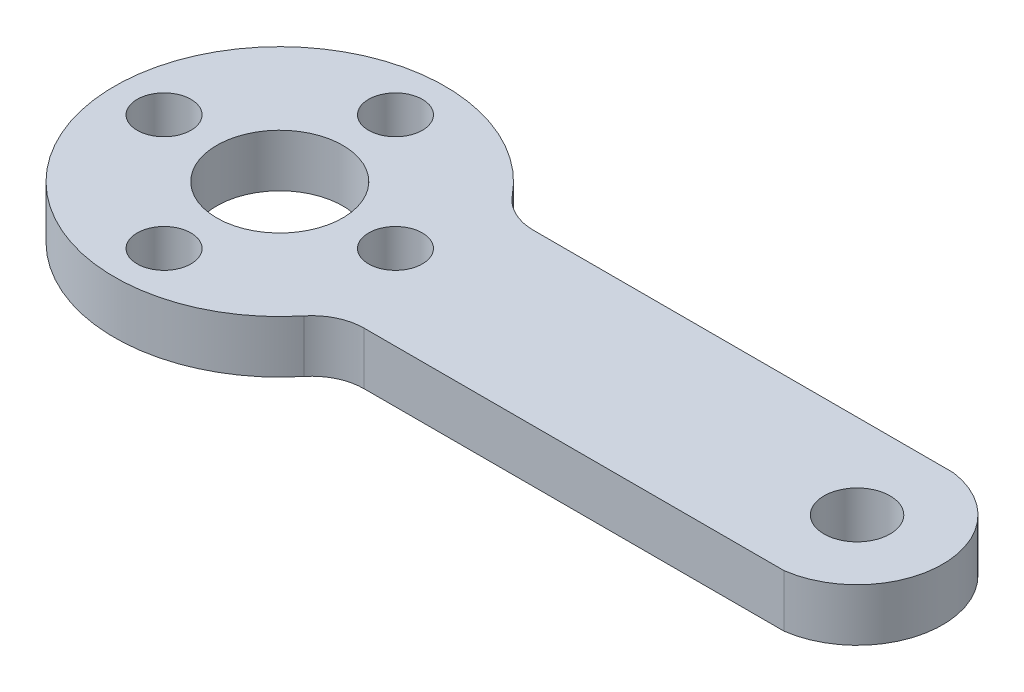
from build123d import *

# Parameters (mm, degrees)
SKETCH1_R           = 2
SKETCH1_R_2         = 1.627000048
SKETCH1_R_3         = 3.81
BOSS_EXTRUDE1_DEPTH = 3.175
FILLET1_R           = 3.175


with BuildPart() as part:
    # Sketch1 → Boss-Extrude1 (new body)
    with BuildSketch(Plane(origin=(0, 0, 0), x_dir=(1, 0, 0), z_dir=(0, 1, 0))):
        with BuildLine():
            Line((35.639942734, 5.125376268), (8.586647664, 5.125376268))
            ThreePointArc((8.586647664, 5.125376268), (5.527225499, 8.333653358), (1.381531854, 9.90410873))
            ThreePointArc((1.381531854, 9.90410873), (-10, 0), (1.381531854, -9.90410873))
            ThreePointArc((1.381531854, -9.90410873), (5.527225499, -8.333653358), (8.586647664, -5.125376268))
            Line((8.586647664, -5.125376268), (35.639942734, -5.125376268))
            ThreePointArc((35.639942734, -5.125376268), (40.1, 0), (35.639942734, 5.125376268))
        make_face()
        with Locations(Location((34.925, 0, 0), (0, 0, 270))):
            Circle(SKETCH1_R, mode=Mode.SUBTRACT)
        with Locations(Location((0, 7, 0), (0, 0, 270))):
            Circle(SKETCH1_R_2, mode=Mode.SUBTRACT)
        with Locations(Location((7, 0, 0), (0, 0, 270))):
            Circle(SKETCH1_R_2, mode=Mode.SUBTRACT)
        with Locations(Location((0, -7, 0), (0, 0, 270))):
            Circle(SKETCH1_R_2, mode=Mode.SUBTRACT)
        with Locations(Location((-7, 0, 0), (0, 0, 270))):
            Circle(SKETCH1_R_2, mode=Mode.SUBTRACT)
        with Locations(Location((0, 0, 0), (0, 0, 270))):
            Circle(SKETCH1_R_3, mode=Mode.SUBTRACT)
    extrude(amount=BOSS_EXTRUDE1_DEPTH)

    # Fillet1
    fillet1_edges = [part.edges().sort_by_distance(p)[0] for p in [
        (8.586647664, 1.5875, -5.125376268),
        (8.586647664, 1.5875, 5.125376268),
    ]]
    fillet(fillet1_edges, radius=FILLET1_R)


solid = part.part
